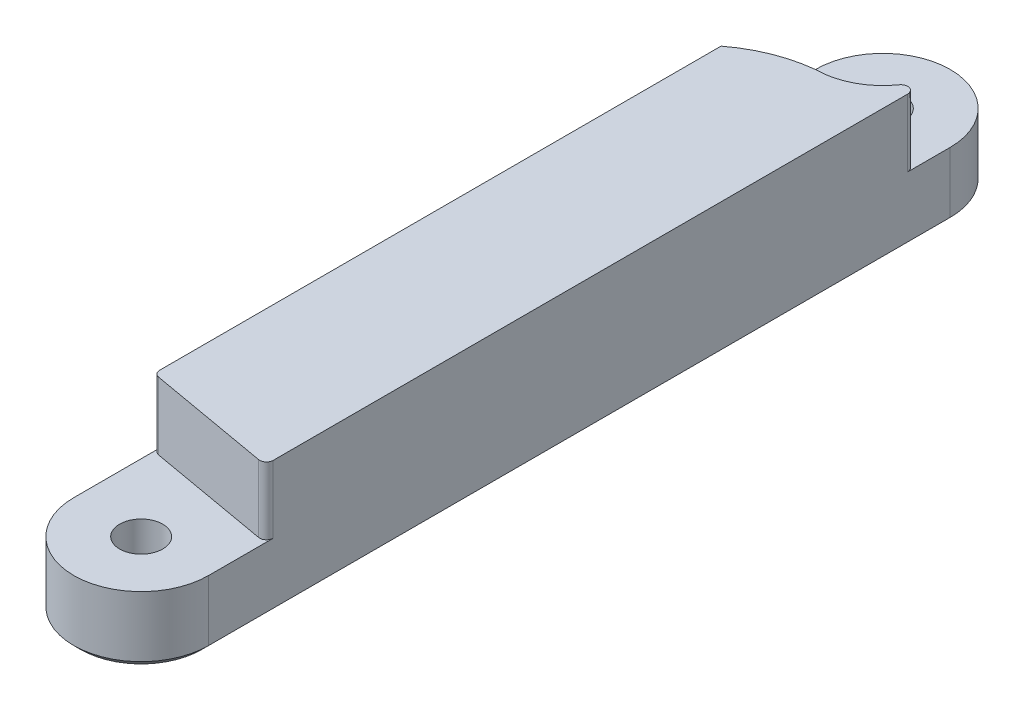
from build123d import *

# Parameters (mm, degrees)
CENTER_BODY_DEPTH               = 10
SKETCH1_3_R                     = 1.6
SKETCH1_3_R_2                   = 1.6000000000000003
CONNECTOR_BODY_DEPTH            = 5
MECH_LOCK_LEFT_DEPTH            = 5
DULLING_FILLET_GENERAL_R        = 0.5
ELEPHANTSFOOT_COMPENSATION_SIZE = 0.5
DULLING_FILLET_LEFT_R           = 0.5


with BuildPart() as part:
    # complete_sketch → center_body (new body)
    with BuildSketch(Plane(origin=(0, 0, 0), x_dir=(1, 0, 0), z_dir=(0, 1, 0))):
        Polygon((-5, 47), (-5, 5.958767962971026), (5, 4.195498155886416), (5, 47), align=None)
    extrude(amount=CENTER_BODY_DEPTH)

    # Sketch1_3 → connector_body (add)
    # profile 1 of 2: a face of its own
    with BuildSketch(Plane(origin=(0, 0, 0), x_dir=(1, 0, 0), z_dir=(0, 1, 0))):
        with BuildLine():
            Line((-5, 5.958767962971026), (-5, 0))
            ThreePointArc((-5, 0), (-3.1e-16, -5), (5, -6.1e-16))
            Line((5, 0), (5, 4.195498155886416))
            Line((5, 4.195498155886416), (-5, 5.958767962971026))
        make_face()
        with Locations(Location((0, 0, 0), (0, 0, 270))):
            Circle(SKETCH1_3_R, mode=Mode.SUBTRACT)
    # profile 2 of 2: a face of its own
    with BuildSketch(Plane(origin=(0, 0, 0), x_dir=(1, 0, 0), z_dir=(0, 1, 0))):
        with BuildLine():
            Line((-5, 52.70871215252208), (-5, 47))
            Line((-5, 47), (5, 47))
            Line((5, 47), (5, 52.70871215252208))
            Line((5, 52.70871215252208), (5, 55))
            ThreePointArc((5, 55), (-1.4e-16, 60), (-5, 55))
            Line((-5, 55), (-5, 52.70871215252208))
        make_face()
        with Locations(Location((0, 55, 0), (0, 0, 270))):
            Circle(SKETCH1_3_R_2, mode=Mode.SUBTRACT)
    extrude(amount=CONNECTOR_BODY_DEPTH)

    # Sketch1 → mech_lock_left (add)
    with BuildSketch(Plane(origin=(0, 5, 0), x_dir=(1, 0, 0), z_dir=(0, 1, 0))):
        with BuildLine():
            Line((-5, 47), (5, 47))
            Line((5, 47), (5, 55))
            ThreePointArc((5, 55), (3.535533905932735, 51.46446609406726), (0, 49.99999999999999))
            ThreePointArc((0, 49.99999999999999), (-2.637161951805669, 49.34290487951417), (-4.999999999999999, 48))
            Line((-4.999999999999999, 48), (-5, 47))
        make_face()
    extrude(amount=MECH_LOCK_LEFT_DEPTH)

    # dulling_fillet_general
    dulling_fillet_general_edges = [part.edges().sort_by_distance(p)[0] for p in [
        (5, 7.5, -4.195498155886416),
        (-5, 7.5, -5.958767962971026),
    ]]
    fillet(dulling_fillet_general_edges, radius=DULLING_FILLET_GENERAL_R)

    # elephantsfoot_compensation
    elephantsfoot_compensation_edges = [part.edges().sort_by_distance(p)[0] for p in [
        (1.4e-16, 0, 5),
        (4.9e-16, 0, -1.6),
        (-1.4e-16, 0, -60),
        (4.9e-16, 0, -56.6),
        (5, 0, -27.5),
        (-5, 0, -27.5),
    ]]
    chamfer(elephantsfoot_compensation_edges, length=ELEPHANTSFOOT_COMPENSATION_SIZE)

    # dulling_fillet_left
    dulling_fillet_left_edges = [part.edges().sort_by_distance(p)[0] for p in [
        (5, 7.5, -55),
    ]]
    fillet(dulling_fillet_left_edges, radius=DULLING_FILLET_LEFT_R)


solid = part.part
